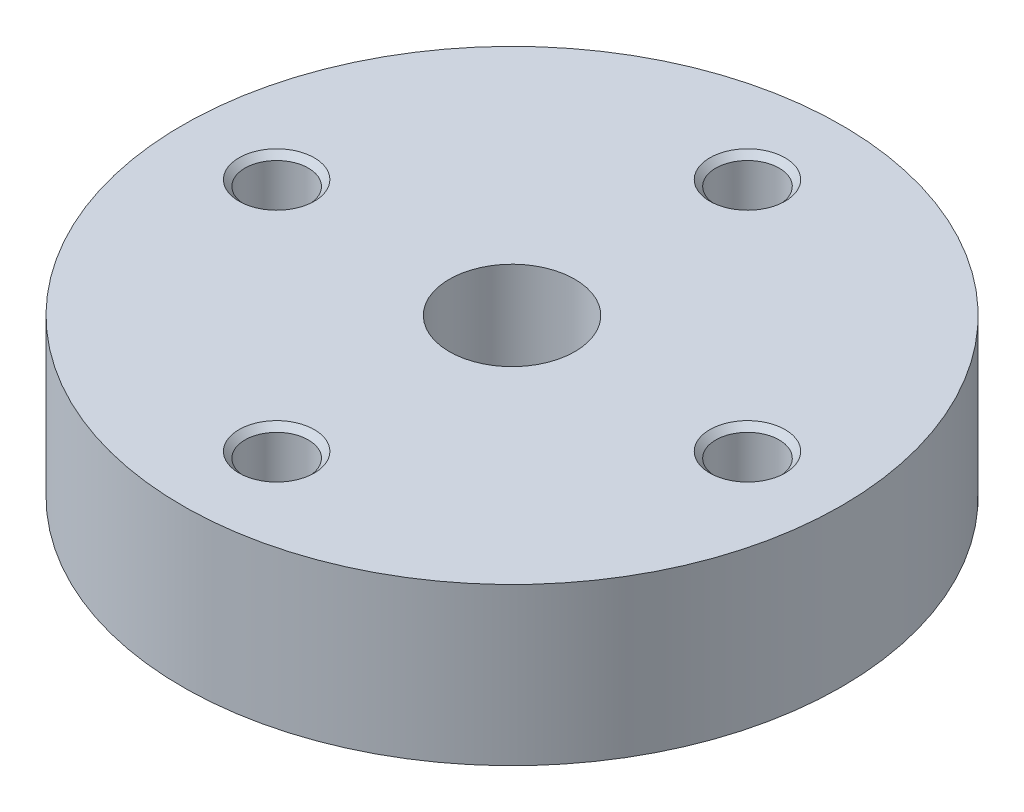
ISO-10303-21;
HEADER;
FILE_DESCRIPTION(('STEP AP214'),'2;1');
FILE_NAME('part.step','',(''),(''),'','','');
FILE_SCHEMA(('AUTOMOTIVE_DESIGN { 1 0 10303 214 1 1 1 1 }'));
ENDSEC;
DATA;
#1=APPLICATION_CONTEXT('core data for automotive mechanical design processes');
#2=APPLICATION_PROTOCOL_DEFINITION('international standard','automotive_design',2000,#1);
#3=PRODUCT_CONTEXT('',#1,'mechanical');
#4=PRODUCT('Part','Part','',(#3));
#5=PRODUCT_RELATED_PRODUCT_CATEGORY('part','',(#4));
#6=PRODUCT_DEFINITION_FORMATION('','',#4);
#7=PRODUCT_DEFINITION_CONTEXT('part definition',#1,'design');
#8=PRODUCT_DEFINITION('design','',#6,#7);
#9=PRODUCT_DEFINITION_SHAPE('','',#8);
#10=(LENGTH_UNIT() NAMED_UNIT(*) SI_UNIT(.MILLI.,.METRE.));
#11=(NAMED_UNIT(*) PLANE_ANGLE_UNIT() SI_UNIT($,.RADIAN.));
#12=(NAMED_UNIT(*) SI_UNIT($,.STERADIAN.) SOLID_ANGLE_UNIT());
#13=UNCERTAINTY_MEASURE_WITH_UNIT(LENGTH_MEASURE(1.E-05),#10,'distance_accuracy_value','');
#14=(GEOMETRIC_REPRESENTATION_CONTEXT(3) GLOBAL_UNCERTAINTY_ASSIGNED_CONTEXT((#13)) GLOBAL_UNIT_ASSIGNED_CONTEXT((#10,
#11,#12)) REPRESENTATION_CONTEXT('',''));
#15=CARTESIAN_POINT('',(0.,0.,0.));
#16=DIRECTION('',(0.,0.,1.));
#17=DIRECTION('',(1.,0.,0.));
#18=AXIS2_PLACEMENT_3D('',#15,#16,#17);
#19=CARTESIAN_POINT('',(0.,12.5,0.));
#20=DIRECTION('',(0.,-1.,0.));
#21=DIRECTION('',(1.,0.,0.));
#22=AXIS2_PLACEMENT_3D('',#19,#20,#21);
#23=CYLINDRICAL_SURFACE('',#22,52.5);
#24=CARTESIAN_POINT('',(0.,0.,0.));
#25=DIRECTION('',(0.,1.,0.));
#26=DIRECTION('',(1.,0.,0.));
#27=AXIS2_PLACEMENT_3D('',#24,#25,#26);
#28=CIRCLE('',#27,52.5);
#29=CARTESIAN_POINT('',(52.5,0.,0.));
#30=VERTEX_POINT('',#29);
#31=EDGE_CURVE('E9',#30,#30,#28,.T.);
#32=ORIENTED_EDGE('',*,*,#31,.T.);
#33=EDGE_LOOP('',(#32));
#34=FACE_BOUND('',#33,.T.);
#35=CARTESIAN_POINT('',(0.,25.,0.));
#36=DIRECTION('',(0.,1.,0.));
#37=DIRECTION('',(1.,0.,0.));
#38=AXIS2_PLACEMENT_3D('',#35,#36,#37);
#39=CIRCLE('',#38,52.5);
#40=CARTESIAN_POINT('',(52.5,25.,0.));
#41=VERTEX_POINT('',#40);
#42=EDGE_CURVE('E125',#41,#41,#39,.T.);
#43=ORIENTED_EDGE('',*,*,#42,.F.);
#44=EDGE_LOOP('',(#43));
#45=FACE_BOUND('',#44,.T.);
#46=ADVANCED_FACE('F15',(#34,#45),#23,.T.);
#47=CARTESIAN_POINT('',(31.25,0.,0.));
#48=DIRECTION('',(0.,-1.,0.));
#49=DIRECTION('',(-1.,0.,0.));
#50=AXIS2_PLACEMENT_3D('',#47,#48,#49);
#51=PLANE('',#50);
#52=CARTESIAN_POINT('',(0.,0.,0.));
#53=DIRECTION('',(0.,1.,0.));
#54=DIRECTION('',(1.,0.,0.));
#55=AXIS2_PLACEMENT_3D('',#52,#53,#54);
#56=CIRCLE('',#55,10.);
#57=CARTESIAN_POINT('',(10.,0.,0.));
#58=VERTEX_POINT('',#57);
#59=EDGE_CURVE('E22',#58,#58,#56,.T.);
#60=ORIENTED_EDGE('',*,*,#59,.T.);
#61=EDGE_LOOP('',(#60));
#62=FACE_BOUND('',#61,.T.);
#63=ORIENTED_EDGE('',*,*,#31,.F.);
#64=EDGE_LOOP('',(#63));
#65=FACE_BOUND('',#64,.T.);
#66=ADVANCED_FACE('F198',(#62,#65),#51,.T.);
#67=CARTESIAN_POINT('',(0.,12.5,0.));
#68=DIRECTION('',(0.,-1.,0.));
#69=DIRECTION('',(1.,0.,0.));
#70=AXIS2_PLACEMENT_3D('',#67,#68,#69);
#71=CYLINDRICAL_SURFACE('',#70,10.);
#72=CARTESIAN_POINT('',(0.,25.,0.));
#73=DIRECTION('',(0.,1.,0.));
#74=DIRECTION('',(1.,0.,0.));
#75=AXIS2_PLACEMENT_3D('',#72,#73,#74);
#76=CIRCLE('',#75,10.);
#77=CARTESIAN_POINT('',(10.,25.,0.));
#78=VERTEX_POINT('',#77);
#79=EDGE_CURVE('E121',#78,#78,#76,.T.);
#80=ORIENTED_EDGE('',*,*,#79,.T.);
#81=EDGE_LOOP('',(#80));
#82=FACE_BOUND('',#81,.T.);
#83=ORIENTED_EDGE('',*,*,#59,.F.);
#84=EDGE_LOOP('',(#83));
#85=FACE_BOUND('',#84,.T.);
#86=ADVANCED_FACE('F122',(#82,#85),#71,.F.);
#87=CARTESIAN_POINT('',(31.25,25.,0.));
#88=DIRECTION('',(0.,1.,0.));
#89=DIRECTION('',(1.,0.,0.));
#90=AXIS2_PLACEMENT_3D('',#87,#88,#89);
#91=PLANE('',#90);
#92=ORIENTED_EDGE('',*,*,#42,.T.);
#93=EDGE_LOOP('',(#92));
#94=FACE_BOUND('',#93,.T.);
#95=ORIENTED_EDGE('',*,*,#79,.F.);
#96=EDGE_LOOP('',(#95));
#97=FACE_BOUND('',#96,.T.);
#98=CARTESIAN_POINT('',(37.5,25.,0.));
#99=DIRECTION('',(0.,-1.,0.));
#100=DIRECTION('',(1.,0.,0.));
#101=AXIS2_PLACEMENT_3D('',#98,#99,#100);
#102=CIRCLE('',#101,6.);
#103=CARTESIAN_POINT('',(43.5,25.,0.));
#104=VERTEX_POINT('',#103);
#105=EDGE_CURVE('E170',#104,#104,#102,.T.);
#106=ORIENTED_EDGE('',*,*,#105,.T.);
#107=EDGE_LOOP('',(#106));
#108=FACE_BOUND('',#107,.T.);
#109=CARTESIAN_POINT('',(0.,25.,-37.5));
#110=DIRECTION('',(0.,-1.,0.));
#111=DIRECTION('',(0.,0.,-1.));
#112=AXIS2_PLACEMENT_3D('',#109,#110,#111);
#113=CIRCLE('',#112,6.);
#114=CARTESIAN_POINT('',(0.,25.,-43.5));
#115=VERTEX_POINT('',#114);
#116=EDGE_CURVE('E144',#115,#115,#113,.T.);
#117=ORIENTED_EDGE('',*,*,#116,.T.);
#118=EDGE_LOOP('',(#117));
#119=FACE_BOUND('',#118,.T.);
#120=CARTESIAN_POINT('',(-37.5,25.,0.));
#121=DIRECTION('',(0.,-1.,0.));
#122=DIRECTION('',(-1.,0.,0.));
#123=AXIS2_PLACEMENT_3D('',#120,#121,#122);
#124=CIRCLE('',#123,6.);
#125=CARTESIAN_POINT('',(-43.5,25.,0.));
#126=VERTEX_POINT('',#125);
#127=EDGE_CURVE('E132',#126,#126,#124,.T.);
#128=ORIENTED_EDGE('',*,*,#127,.T.);
#129=EDGE_LOOP('',(#128));
#130=FACE_BOUND('',#129,.T.);
#131=CARTESIAN_POINT('',(0.,25.,37.5));
#132=DIRECTION('',(0.,-1.,0.));
#133=DIRECTION('',(0.,0.,1.));
#134=AXIS2_PLACEMENT_3D('',#131,#132,#133);
#135=CIRCLE('',#134,6.);
#136=CARTESIAN_POINT('',(0.,25.,43.5));
#137=VERTEX_POINT('',#136);
#138=EDGE_CURVE('E141',#137,#137,#135,.T.);
#139=ORIENTED_EDGE('',*,*,#138,.T.);
#140=EDGE_LOOP('',(#139));
#141=FACE_BOUND('',#140,.T.);
#142=ADVANCED_FACE('F189',(#94,#97,#108,#119,#130,#141),#91,.T.);
#143=CARTESIAN_POINT('',(37.5,5.54137867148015,0.));
#144=DIRECTION('',(0.,1.,0.));
#145=DIRECTION('',(1.,0.,0.));
#146=AXIS2_PLACEMENT_3D('',#143,#144,#145);
#147=CONICAL_SURFACE('',#146,2.52640625,1.0471975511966);
#148=CARTESIAN_POINT('',(37.5,7.,0.));
#149=DIRECTION('',(0.,-1.,0.));
#150=DIRECTION('',(1.,0.,0.));
#151=AXIS2_PLACEMENT_3D('',#148,#149,#150);
#152=CIRCLE('',#151,5.0528125);
#153=CARTESIAN_POINT('',(42.5528125,7.,0.));
#154=VERTEX_POINT('',#153);
#155=EDGE_CURVE('E126',#154,#154,#152,.T.);
#156=ORIENTED_EDGE('',*,*,#155,.F.);
#157=EDGE_LOOP('',(#156));
#158=FACE_BOUND('',#157,.T.);
#159=CARTESIAN_POINT('',(37.5,4.08275734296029,0.));
#160=VERTEX_POINT('',#159);
#161=VERTEX_LOOP('',#160);
#162=FACE_BOUND('',#161,.T.);
#163=ADVANCED_FACE('F183',(#158,#162),#147,.F.);
#164=CARTESIAN_POINT('',(37.5,9.52640625,0.));
#165=DIRECTION('',(0.,1.,0.));
#166=DIRECTION('',(1.,0.,0.));
#167=AXIS2_PLACEMENT_3D('',#164,#165,#166);
#168=CYLINDRICAL_SURFACE('',#167,5.0528125);
#169=CARTESIAN_POINT('',(37.5,12.0528125,0.));
#170=DIRECTION('',(0.,-1.,0.));
#171=DIRECTION('',(1.,0.,0.));
#172=AXIS2_PLACEMENT_3D('',#169,#170,#171);
#173=CIRCLE('',#172,5.0528125);
#174=CARTESIAN_POINT('',(42.5528125,12.0528125,0.));
#175=VERTEX_POINT('',#174);
#176=EDGE_CURVE('E129',#175,#175,#173,.T.);
#177=ORIENTED_EDGE('',*,*,#176,.F.);
#178=EDGE_LOOP('',(#177));
#179=FACE_BOUND('',#178,.T.);
#180=ORIENTED_EDGE('',*,*,#155,.T.);
#181=EDGE_LOOP('',(#180));
#182=FACE_BOUND('',#181,.T.);
#183=ADVANCED_FACE('F180',(#179,#182),#168,.F.);
#184=CARTESIAN_POINT('',(37.5,12.52640625,0.));
#185=DIRECTION('',(0.,1.,0.));
#186=DIRECTION('',(1.,0.,0.));
#187=AXIS2_PLACEMENT_3D('',#184,#185,#186);
#188=CONICAL_SURFACE('',#187,5.52640625,0.785398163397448);
#189=CARTESIAN_POINT('',(37.5,13.,0.));
#190=DIRECTION('',(0.,-1.,0.));
#191=DIRECTION('',(1.,0.,0.));
#192=AXIS2_PLACEMENT_3D('',#189,#190,#191);
#193=CIRCLE('',#192,6.);
#194=CARTESIAN_POINT('',(43.5,13.,0.));
#195=VERTEX_POINT('',#194);
#196=EDGE_CURVE('E174',#195,#195,#193,.T.);
#197=ORIENTED_EDGE('',*,*,#196,.F.);
#198=EDGE_LOOP('',(#197));
#199=FACE_BOUND('',#198,.T.);
#200=ORIENTED_EDGE('',*,*,#176,.T.);
#201=EDGE_LOOP('',(#200));
#202=FACE_BOUND('',#201,.T.);
#203=ADVANCED_FACE('F178',(#199,#202),#188,.F.);
#204=CARTESIAN_POINT('',(43.02640625,13.,0.));
#205=DIRECTION('',(0.,1.,0.));
#206=DIRECTION('',(-1.,0.,0.));
#207=AXIS2_PLACEMENT_3D('',#204,#205,#206);
#208=PLANE('',#207);
#209=CARTESIAN_POINT('',(37.5,13.,0.));
#210=DIRECTION('',(0.,-1.,0.));
#211=DIRECTION('',(1.,0.,0.));
#212=AXIS2_PLACEMENT_3D('',#209,#210,#211);
#213=CIRCLE('',#212,5.0528125);
#214=CARTESIAN_POINT('',(42.5528125,13.,0.));
#215=VERTEX_POINT('',#214);
#216=EDGE_CURVE('E172',#215,#215,#213,.T.);
#217=ORIENTED_EDGE('',*,*,#216,.F.);
#218=EDGE_LOOP('',(#217));
#219=FACE_BOUND('',#218,.T.);
#220=ORIENTED_EDGE('',*,*,#196,.T.);
#221=EDGE_LOOP('',(#220));
#222=FACE_BOUND('',#221,.T.);
#223=ADVANCED_FACE('F299',(#219,#222),#208,.F.);
#224=CARTESIAN_POINT('',(37.5,18.52640625,0.));
#225=DIRECTION('',(0.,1.,0.));
#226=DIRECTION('',(1.,0.,0.));
#227=AXIS2_PLACEMENT_3D('',#224,#225,#226);
#228=CYLINDRICAL_SURFACE('',#227,5.0528125);
#229=CARTESIAN_POINT('',(37.5,24.0528125,0.));
#230=DIRECTION('',(0.,-1.,0.));
#231=DIRECTION('',(1.,0.,0.));
#232=AXIS2_PLACEMENT_3D('',#229,#230,#231);
#233=CIRCLE('',#232,5.0528125);
#234=CARTESIAN_POINT('',(42.5528125,24.0528125,0.));
#235=VERTEX_POINT('',#234);
#236=EDGE_CURVE('E168',#235,#235,#233,.T.);
#237=ORIENTED_EDGE('',*,*,#236,.F.);
#238=EDGE_LOOP('',(#237));
#239=FACE_BOUND('',#238,.T.);
#240=ORIENTED_EDGE('',*,*,#216,.T.);
#241=EDGE_LOOP('',(#240));
#242=FACE_BOUND('',#241,.T.);
#243=ADVANCED_FACE('F295',(#239,#242),#228,.F.);
#244=CARTESIAN_POINT('',(37.5,24.52640625,0.));
#245=DIRECTION('',(0.,1.,0.));
#246=DIRECTION('',(1.,0.,0.));
#247=AXIS2_PLACEMENT_3D('',#244,#245,#246);
#248=CONICAL_SURFACE('',#247,5.52640625,0.785398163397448);
#249=ORIENTED_EDGE('',*,*,#105,.F.);
#250=EDGE_LOOP('',(#249));
#251=FACE_BOUND('',#250,.T.);
#252=ORIENTED_EDGE('',*,*,#236,.T.);
#253=EDGE_LOOP('',(#252));
#254=FACE_BOUND('',#253,.T.);
#255=ADVANCED_FACE('F291',(#251,#254),#248,.F.);
#256=CARTESIAN_POINT('',(0.,5.54137867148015,-37.5));
#257=DIRECTION('',(0.,1.,0.));
#258=DIRECTION('',(0.,0.,-1.));
#259=AXIS2_PLACEMENT_3D('',#256,#257,#258);
#260=CONICAL_SURFACE('',#259,2.52640625,1.0471975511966);
#261=CARTESIAN_POINT('',(0.,7.,-37.5));
#262=DIRECTION('',(0.,-1.,0.));
#263=DIRECTION('',(0.,0.,-1.));
#264=AXIS2_PLACEMENT_3D('',#261,#262,#263);
#265=CIRCLE('',#264,5.0528125);
#266=CARTESIAN_POINT('',(0.,7.,-42.5528125));
#267=VERTEX_POINT('',#266);
#268=EDGE_CURVE('E166',#267,#267,#265,.T.);
#269=ORIENTED_EDGE('',*,*,#268,.F.);
#270=EDGE_LOOP('',(#269));
#271=FACE_BOUND('',#270,.T.);
#272=CARTESIAN_POINT('',(0.,4.08275734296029,-37.5));
#273=VERTEX_POINT('',#272);
#274=VERTEX_LOOP('',#273);
#275=FACE_BOUND('',#274,.T.);
#276=ADVANCED_FACE('F287',(#271,#275),#260,.F.);
#277=CARTESIAN_POINT('',(0.,9.52640625,-37.5));
#278=DIRECTION('',(0.,1.,0.));
#279=DIRECTION('',(0.,0.,-1.));
#280=AXIS2_PLACEMENT_3D('',#277,#278,#279);
#281=CYLINDRICAL_SURFACE('',#280,5.0528125);
#282=CARTESIAN_POINT('',(0.,12.0528125,-37.5));
#283=DIRECTION('',(0.,-1.,0.));
#284=DIRECTION('',(0.,0.,-1.));
#285=AXIS2_PLACEMENT_3D('',#282,#283,#284);
#286=CIRCLE('',#285,5.0528125);
#287=CARTESIAN_POINT('',(0.,12.0528125,-42.5528125));
#288=VERTEX_POINT('',#287);
#289=EDGE_CURVE('E164',#288,#288,#286,.T.);
#290=ORIENTED_EDGE('',*,*,#289,.F.);
#291=EDGE_LOOP('',(#290));
#292=FACE_BOUND('',#291,.T.);
#293=ORIENTED_EDGE('',*,*,#268,.T.);
#294=EDGE_LOOP('',(#293));
#295=FACE_BOUND('',#294,.T.);
#296=ADVANCED_FACE('F283',(#292,#295),#281,.F.);
#297=CARTESIAN_POINT('',(0.,12.52640625,-37.5));
#298=DIRECTION('',(0.,1.,0.));
#299=DIRECTION('',(0.,0.,-1.));
#300=AXIS2_PLACEMENT_3D('',#297,#298,#299);
#301=CONICAL_SURFACE('',#300,5.52640625,0.785398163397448);
#302=CARTESIAN_POINT('',(0.,13.,-37.5));
#303=DIRECTION('',(0.,-1.,0.));
#304=DIRECTION('',(0.,0.,-1.));
#305=AXIS2_PLACEMENT_3D('',#302,#303,#304);
#306=CIRCLE('',#305,6.);
#307=CARTESIAN_POINT('',(0.,13.,-43.5));
#308=VERTEX_POINT('',#307);
#309=EDGE_CURVE('E162',#308,#308,#306,.T.);
#310=ORIENTED_EDGE('',*,*,#309,.F.);
#311=EDGE_LOOP('',(#310));
#312=FACE_BOUND('',#311,.T.);
#313=ORIENTED_EDGE('',*,*,#289,.T.);
#314=EDGE_LOOP('',(#313));
#315=FACE_BOUND('',#314,.T.);
#316=ADVANCED_FACE('F279',(#312,#315),#301,.F.);
#317=CARTESIAN_POINT('',(0.,13.,-43.02640625));
#318=DIRECTION('',(0.,1.,0.));
#319=DIRECTION('',(0.,0.,1.));
#320=AXIS2_PLACEMENT_3D('',#317,#318,#319);
#321=PLANE('',#320);
#322=CARTESIAN_POINT('',(0.,13.,-37.5));
#323=DIRECTION('',(0.,-1.,0.));
#324=DIRECTION('',(0.,0.,-1.));
#325=AXIS2_PLACEMENT_3D('',#322,#323,#324);
#326=CIRCLE('',#325,5.0528125);
#327=CARTESIAN_POINT('',(0.,13.,-42.5528125));
#328=VERTEX_POINT('',#327);
#329=EDGE_CURVE('E146',#328,#328,#326,.T.);
#330=ORIENTED_EDGE('',*,*,#329,.F.);
#331=EDGE_LOOP('',(#330));
#332=FACE_BOUND('',#331,.T.);
#333=ORIENTED_EDGE('',*,*,#309,.T.);
#334=EDGE_LOOP('',(#333));
#335=FACE_BOUND('',#334,.T.);
#336=ADVANCED_FACE('F275',(#332,#335),#321,.F.);
#337=CARTESIAN_POINT('',(0.,18.52640625,-37.5));
#338=DIRECTION('',(0.,1.,0.));
#339=DIRECTION('',(0.,0.,-1.));
#340=AXIS2_PLACEMENT_3D('',#337,#338,#339);
#341=CYLINDRICAL_SURFACE('',#340,5.0528125);
#342=CARTESIAN_POINT('',(0.,24.0528125,-37.5));
#343=DIRECTION('',(0.,-1.,0.));
#344=DIRECTION('',(0.,0.,-1.));
#345=AXIS2_PLACEMENT_3D('',#342,#343,#344);
#346=CIRCLE('',#345,5.0528125);
#347=CARTESIAN_POINT('',(0.,24.0528125,-42.5528125));
#348=VERTEX_POINT('',#347);
#349=EDGE_CURVE('E147',#348,#348,#346,.T.);
#350=ORIENTED_EDGE('',*,*,#349,.F.);
#351=EDGE_LOOP('',(#350));
#352=FACE_BOUND('',#351,.T.);
#353=ORIENTED_EDGE('',*,*,#329,.T.);
#354=EDGE_LOOP('',(#353));
#355=FACE_BOUND('',#354,.T.);
#356=ADVANCED_FACE('F259',(#352,#355),#341,.F.);
#357=CARTESIAN_POINT('',(0.,24.52640625,-37.5));
#358=DIRECTION('',(0.,1.,0.));
#359=DIRECTION('',(0.,0.,-1.));
#360=AXIS2_PLACEMENT_3D('',#357,#358,#359);
#361=CONICAL_SURFACE('',#360,5.52640625,0.785398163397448);
#362=ORIENTED_EDGE('',*,*,#116,.F.);
#363=EDGE_LOOP('',(#362));
#364=FACE_BOUND('',#363,.T.);
#365=ORIENTED_EDGE('',*,*,#349,.T.);
#366=EDGE_LOOP('',(#365));
#367=FACE_BOUND('',#366,.T.);
#368=ADVANCED_FACE('F255',(#364,#367),#361,.F.);
#369=CARTESIAN_POINT('',(-37.5,5.54137867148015,0.));
#370=DIRECTION('',(0.,1.,0.));
#371=DIRECTION('',(-1.,0.,0.));
#372=AXIS2_PLACEMENT_3D('',#369,#370,#371);
#373=CONICAL_SURFACE('',#372,2.52640625,1.0471975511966);
#374=CARTESIAN_POINT('',(-37.5,7.,0.));
#375=DIRECTION('',(0.,-1.,0.));
#376=DIRECTION('',(-1.,0.,0.));
#377=AXIS2_PLACEMENT_3D('',#374,#375,#376);
#378=CIRCLE('',#377,5.0528125);
#379=CARTESIAN_POINT('',(-42.5528125,7.,0.));
#380=VERTEX_POINT('',#379);
#381=EDGE_CURVE('E148',#380,#380,#378,.T.);
#382=ORIENTED_EDGE('',*,*,#381,.F.);
#383=EDGE_LOOP('',(#382));
#384=FACE_BOUND('',#383,.T.);
#385=CARTESIAN_POINT('',(-37.5,4.08275734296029,0.));
#386=VERTEX_POINT('',#385);
#387=VERTEX_LOOP('',#386);
#388=FACE_BOUND('',#387,.T.);
#389=ADVANCED_FACE('F258',(#384,#388),#373,.F.);
#390=CARTESIAN_POINT('',(-37.5,9.52640625,0.));
#391=DIRECTION('',(0.,1.,0.));
#392=DIRECTION('',(-1.,0.,0.));
#393=AXIS2_PLACEMENT_3D('',#390,#391,#392);
#394=CYLINDRICAL_SURFACE('',#393,5.0528125);
#395=CARTESIAN_POINT('',(-37.5,12.0528125,0.));
#396=DIRECTION('',(0.,-1.,0.));
#397=DIRECTION('',(-1.,0.,0.));
#398=AXIS2_PLACEMENT_3D('',#395,#396,#397);
#399=CIRCLE('',#398,5.0528125);
#400=CARTESIAN_POINT('',(-42.5528125,12.0528125,0.));
#401=VERTEX_POINT('',#400);
#402=EDGE_CURVE('E150',#401,#401,#399,.T.);
#403=ORIENTED_EDGE('',*,*,#402,.F.);
#404=EDGE_LOOP('',(#403));
#405=FACE_BOUND('',#404,.T.);
#406=ORIENTED_EDGE('',*,*,#381,.T.);
#407=EDGE_LOOP('',(#406));
#408=FACE_BOUND('',#407,.T.);
#409=ADVANCED_FACE('F271',(#405,#408),#394,.F.);
#410=CARTESIAN_POINT('',(-37.5,12.52640625,0.));
#411=DIRECTION('',(0.,1.,0.));
#412=DIRECTION('',(-1.,0.,0.));
#413=AXIS2_PLACEMENT_3D('',#410,#411,#412);
#414=CONICAL_SURFACE('',#413,5.52640625,0.785398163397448);
#415=CARTESIAN_POINT('',(-37.5,13.,0.));
#416=DIRECTION('',(0.,-1.,0.));
#417=DIRECTION('',(-1.,0.,0.));
#418=AXIS2_PLACEMENT_3D('',#415,#416,#417);
#419=CIRCLE('',#418,6.);
#420=CARTESIAN_POINT('',(-43.5,13.,0.));
#421=VERTEX_POINT('',#420);
#422=EDGE_CURVE('E158',#421,#421,#419,.T.);
#423=ORIENTED_EDGE('',*,*,#422,.F.);
#424=EDGE_LOOP('',(#423));
#425=FACE_BOUND('',#424,.T.);
#426=ORIENTED_EDGE('',*,*,#402,.T.);
#427=EDGE_LOOP('',(#426));
#428=FACE_BOUND('',#427,.T.);
#429=ADVANCED_FACE('F267',(#425,#428),#414,.F.);
#430=CARTESIAN_POINT('',(-43.02640625,13.,0.));
#431=DIRECTION('',(0.,1.,0.));
#432=DIRECTION('',(1.,0.,0.));
#433=AXIS2_PLACEMENT_3D('',#430,#431,#432);
#434=PLANE('',#433);
#435=CARTESIAN_POINT('',(-37.5,13.,0.));
#436=DIRECTION('',(0.,-1.,0.));
#437=DIRECTION('',(-1.,0.,0.));
#438=AXIS2_PLACEMENT_3D('',#435,#436,#437);
#439=CIRCLE('',#438,5.0528125);
#440=CARTESIAN_POINT('',(-42.5528125,13.,0.));
#441=VERTEX_POINT('',#440);
#442=EDGE_CURVE('E134',#441,#441,#439,.T.);
#443=ORIENTED_EDGE('',*,*,#442,.F.);
#444=EDGE_LOOP('',(#443));
#445=FACE_BOUND('',#444,.T.);
#446=ORIENTED_EDGE('',*,*,#422,.T.);
#447=EDGE_LOOP('',(#446));
#448=FACE_BOUND('',#447,.T.);
#449=ADVANCED_FACE('F263',(#445,#448),#434,.F.);
#450=CARTESIAN_POINT('',(-37.5,18.52640625,0.));
#451=DIRECTION('',(0.,1.,0.));
#452=DIRECTION('',(-1.,0.,0.));
#453=AXIS2_PLACEMENT_3D('',#450,#451,#452);
#454=CYLINDRICAL_SURFACE('',#453,5.0528125);
#455=CARTESIAN_POINT('',(-37.5,24.0528125,0.));
#456=DIRECTION('',(0.,-1.,0.));
#457=DIRECTION('',(-1.,0.,0.));
#458=AXIS2_PLACEMENT_3D('',#455,#456,#457);
#459=CIRCLE('',#458,5.0528125);
#460=CARTESIAN_POINT('',(-42.5528125,24.0528125,0.));
#461=VERTEX_POINT('',#460);
#462=EDGE_CURVE('E135',#461,#461,#459,.T.);
#463=ORIENTED_EDGE('',*,*,#462,.F.);
#464=EDGE_LOOP('',(#463));
#465=FACE_BOUND('',#464,.T.);
#466=ORIENTED_EDGE('',*,*,#442,.T.);
#467=EDGE_LOOP('',(#466));
#468=FACE_BOUND('',#467,.T.);
#469=ADVANCED_FACE('F251',(#465,#468),#454,.F.);
#470=CARTESIAN_POINT('',(-37.5,24.52640625,0.));
#471=DIRECTION('',(0.,1.,0.));
#472=DIRECTION('',(-1.,0.,0.));
#473=AXIS2_PLACEMENT_3D('',#470,#471,#472);
#474=CONICAL_SURFACE('',#473,5.52640625,0.785398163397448);
#475=ORIENTED_EDGE('',*,*,#127,.F.);
#476=EDGE_LOOP('',(#475));
#477=FACE_BOUND('',#476,.T.);
#478=ORIENTED_EDGE('',*,*,#462,.T.);
#479=EDGE_LOOP('',(#478));
#480=FACE_BOUND('',#479,.T.);
#481=ADVANCED_FACE('F246',(#477,#480),#474,.F.);
#482=CARTESIAN_POINT('',(0.,5.54137867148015,37.5));
#483=DIRECTION('',(0.,1.,0.));
#484=DIRECTION('',(0.,0.,1.));
#485=AXIS2_PLACEMENT_3D('',#482,#483,#484);
#486=CONICAL_SURFACE('',#485,2.52640625,1.0471975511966);
#487=CARTESIAN_POINT('',(0.,7.,37.5));
#488=DIRECTION('',(0.,-1.,0.));
#489=DIRECTION('',(0.,0.,1.));
#490=AXIS2_PLACEMENT_3D('',#487,#488,#489);
#491=CIRCLE('',#490,5.0528125);
#492=CARTESIAN_POINT('',(0.,7.,42.5528125));
#493=VERTEX_POINT('',#492);
#494=EDGE_CURVE('E136',#493,#493,#491,.T.);
#495=ORIENTED_EDGE('',*,*,#494,.F.);
#496=EDGE_LOOP('',(#495));
#497=FACE_BOUND('',#496,.T.);
#498=CARTESIAN_POINT('',(0.,4.08275734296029,37.5));
#499=VERTEX_POINT('',#498);
#500=VERTEX_LOOP('',#499);
#501=FACE_BOUND('',#500,.T.);
#502=ADVANCED_FACE('F240',(#497,#501),#486,.F.);
#503=CARTESIAN_POINT('',(0.,9.52640625,37.5));
#504=DIRECTION('',(0.,1.,0.));
#505=DIRECTION('',(0.,0.,1.));
#506=AXIS2_PLACEMENT_3D('',#503,#504,#505);
#507=CYLINDRICAL_SURFACE('',#506,5.0528125);
#508=CARTESIAN_POINT('',(0.,12.0528125,37.5));
#509=DIRECTION('',(0.,-1.,0.));
#510=DIRECTION('',(0.,0.,1.));
#511=AXIS2_PLACEMENT_3D('',#508,#509,#510);
#512=CIRCLE('',#511,5.0528125);
#513=CARTESIAN_POINT('',(0.,12.0528125,42.5528125));
#514=VERTEX_POINT('',#513);
#515=EDGE_CURVE('E138',#514,#514,#512,.T.);
#516=ORIENTED_EDGE('',*,*,#515,.F.);
#517=EDGE_LOOP('',(#516));
#518=FACE_BOUND('',#517,.T.);
#519=ORIENTED_EDGE('',*,*,#494,.T.);
#520=EDGE_LOOP('',(#519));
#521=FACE_BOUND('',#520,.T.);
#522=ADVANCED_FACE('F234',(#518,#521),#507,.F.);
#523=CARTESIAN_POINT('',(0.,12.52640625,37.5));
#524=DIRECTION('',(0.,1.,0.));
#525=DIRECTION('',(0.,0.,1.));
#526=AXIS2_PLACEMENT_3D('',#523,#524,#525);
#527=CONICAL_SURFACE('',#526,5.52640625,0.785398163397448);
#528=CARTESIAN_POINT('',(0.,13.,37.5));
#529=DIRECTION('',(0.,-1.,0.));
#530=DIRECTION('',(0.,0.,1.));
#531=AXIS2_PLACEMENT_3D('',#528,#529,#530);
#532=CIRCLE('',#531,6.);
#533=CARTESIAN_POINT('',(0.,13.,43.5));
#534=VERTEX_POINT('',#533);
#535=EDGE_CURVE('E153',#534,#534,#532,.T.);
#536=ORIENTED_EDGE('',*,*,#535,.F.);
#537=EDGE_LOOP('',(#536));
#538=FACE_BOUND('',#537,.T.);
#539=ORIENTED_EDGE('',*,*,#515,.T.);
#540=EDGE_LOOP('',(#539));
#541=FACE_BOUND('',#540,.T.);
#542=ADVANCED_FACE('F228',(#538,#541),#527,.F.);
#543=CARTESIAN_POINT('',(0.,13.,43.02640625));
#544=DIRECTION('',(0.,1.,0.));
#545=DIRECTION('',(0.,0.,-1.));
#546=AXIS2_PLACEMENT_3D('',#543,#544,#545);
#547=PLANE('',#546);
#548=CARTESIAN_POINT('',(0.,13.,37.5));
#549=DIRECTION('',(0.,-1.,0.));
#550=DIRECTION('',(0.,0.,1.));
#551=AXIS2_PLACEMENT_3D('',#548,#549,#550);
#552=CIRCLE('',#551,5.0528125);
#553=CARTESIAN_POINT('',(0.,13.,42.5528125));
#554=VERTEX_POINT('',#553);
#555=EDGE_CURVE('E143',#554,#554,#552,.T.);
#556=ORIENTED_EDGE('',*,*,#555,.F.);
#557=EDGE_LOOP('',(#556));
#558=FACE_BOUND('',#557,.T.);
#559=ORIENTED_EDGE('',*,*,#535,.T.);
#560=EDGE_LOOP('',(#559));
#561=FACE_BOUND('',#560,.T.);
#562=ADVANCED_FACE('F222',(#558,#561),#547,.F.);
#563=CARTESIAN_POINT('',(0.,18.52640625,37.5));
#564=DIRECTION('',(0.,1.,0.));
#565=DIRECTION('',(0.,0.,1.));
#566=AXIS2_PLACEMENT_3D('',#563,#564,#565);
#567=CYLINDRICAL_SURFACE('',#566,5.0528125);
#568=CARTESIAN_POINT('',(0.,24.0528125,37.5));
#569=DIRECTION('',(0.,-1.,0.));
#570=DIRECTION('',(0.,0.,1.));
#571=AXIS2_PLACEMENT_3D('',#568,#569,#570);
#572=CIRCLE('',#571,5.0528125);
#573=CARTESIAN_POINT('',(0.,24.0528125,42.5528125));
#574=VERTEX_POINT('',#573);
#575=EDGE_CURVE('E139',#574,#574,#572,.T.);
#576=ORIENTED_EDGE('',*,*,#575,.F.);
#577=EDGE_LOOP('',(#576));
#578=FACE_BOUND('',#577,.T.);
#579=ORIENTED_EDGE('',*,*,#555,.T.);
#580=EDGE_LOOP('',(#579));
#581=FACE_BOUND('',#580,.T.);
#582=ADVANCED_FACE('F216',(#578,#581),#567,.F.);
#583=CARTESIAN_POINT('',(0.,24.52640625,37.5));
#584=DIRECTION('',(0.,1.,0.));
#585=DIRECTION('',(0.,0.,1.));
#586=AXIS2_PLACEMENT_3D('',#583,#584,#585);
#587=CONICAL_SURFACE('',#586,5.52640625,0.785398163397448);
#588=ORIENTED_EDGE('',*,*,#138,.F.);
#589=EDGE_LOOP('',(#588));
#590=FACE_BOUND('',#589,.T.);
#591=ORIENTED_EDGE('',*,*,#575,.T.);
#592=EDGE_LOOP('',(#591));
#593=FACE_BOUND('',#592,.T.);
#594=ADVANCED_FACE('F213',(#590,#593),#587,.F.);
#595=CLOSED_SHELL('',(#46,#66,#86,#142,#163,#183,#203,#223,#243,#255,#276,#296,#316,#336,#356,
#368,#389,#409,#429,#449,#469,#481,#502,#522,#542,#562,#582,#594));
#596=MANIFOLD_SOLID_BREP('B1',#595);
#597=ADVANCED_BREP_SHAPE_REPRESENTATION('',(#18,#596),#14);
#598=SHAPE_DEFINITION_REPRESENTATION(#9,#597);
ENDSEC;
END-ISO-10303-21;
